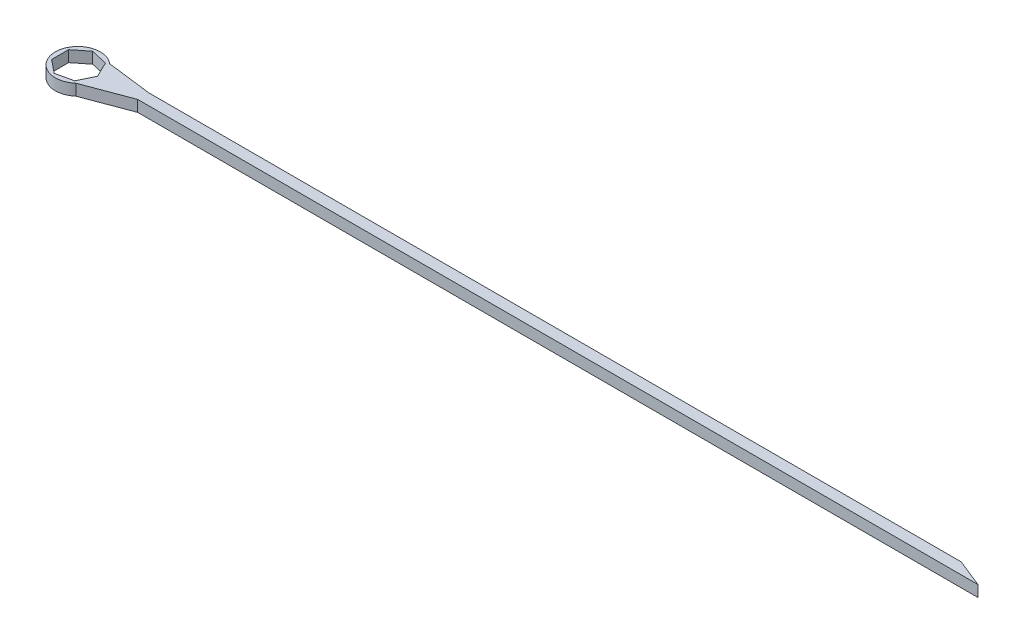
from build123d import *

# Parameters (mm, degrees)
BOSS_EXTRUDE1_DEPTH = 1


with BuildPart() as part:
    # Sketch1 → Boss-Extrude1 (new body)
    with BuildSketch(Plane(origin=(0, 0, 0), x_dir=(1, 0, 0), z_dir=(0, 1, 0))):
        with BuildLine():
            Line((5.322875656, 0), (80, 0))
            Line((80, 0), (77.5, 1))
            Line((77.5, 1), (5.322875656, 1))
            Line((5.322875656, 1), (1.322875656, 1.5))
            ThreePointArc((1.322875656, 1.5), (-2, 0), (1.322875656, -1.5))
            Line((1.322875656, -1.5), (5.322875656, 0))
        make_face()
        Polygon((1.75, 0), (1.091107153, 1.368205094), (-0.389411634, 1.706123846), (-1.576695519, 0.759296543), (-1.576695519, -0.759296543), (-0.389411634, -1.706123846), (1.091107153, -1.368205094), align=None, mode=Mode.SUBTRACT)
    extrude(amount=BOSS_EXTRUDE1_DEPTH)


solid = part.part
